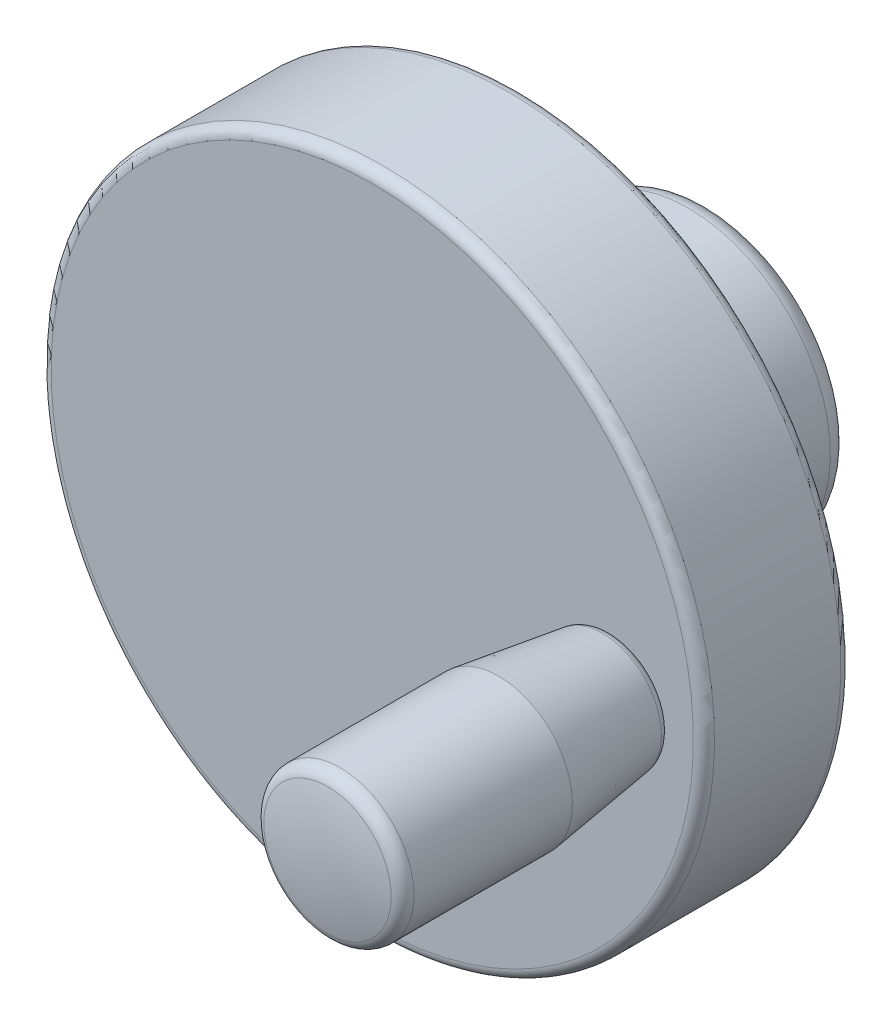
ISO-10303-21;
HEADER;
FILE_DESCRIPTION(('STEP AP214'),'2;1');
FILE_NAME('part.step','',(''),(''),'','','');
FILE_SCHEMA(('AUTOMOTIVE_DESIGN { 1 0 10303 214 1 1 1 1 }'));
ENDSEC;
DATA;
#1=APPLICATION_CONTEXT('core data for automotive mechanical design processes');
#2=APPLICATION_PROTOCOL_DEFINITION('international standard','automotive_design',2000,#1);
#3=PRODUCT_CONTEXT('',#1,'mechanical');
#4=PRODUCT('Part','Part','',(#3));
#5=PRODUCT_RELATED_PRODUCT_CATEGORY('part','',(#4));
#6=PRODUCT_DEFINITION_FORMATION('','',#4);
#7=PRODUCT_DEFINITION_CONTEXT('part definition',#1,'design');
#8=PRODUCT_DEFINITION('design','',#6,#7);
#9=PRODUCT_DEFINITION_SHAPE('','',#8);
#10=(LENGTH_UNIT() NAMED_UNIT(*) SI_UNIT(.MILLI.,.METRE.));
#11=(NAMED_UNIT(*) PLANE_ANGLE_UNIT() SI_UNIT($,.RADIAN.));
#12=(NAMED_UNIT(*) SI_UNIT($,.STERADIAN.) SOLID_ANGLE_UNIT());
#13=UNCERTAINTY_MEASURE_WITH_UNIT(LENGTH_MEASURE(1.E-05),#10,'distance_accuracy_value','');
#14=(GEOMETRIC_REPRESENTATION_CONTEXT(3) GLOBAL_UNCERTAINTY_ASSIGNED_CONTEXT((#13)) GLOBAL_UNIT_ASSIGNED_CONTEXT((#10,
#11,#12)) REPRESENTATION_CONTEXT('',''));
#15=CARTESIAN_POINT('',(0.,0.,0.));
#16=DIRECTION('',(0.,0.,1.));
#17=DIRECTION('',(1.,0.,0.));
#18=AXIS2_PLACEMENT_3D('',#15,#16,#17);
#19=CARTESIAN_POINT('',(7.,0.,0.));
#20=DIRECTION('',(0.,0.,1.));
#21=DIRECTION('',(0.,1.,0.));
#22=AXIS2_PLACEMENT_3D('',#19,#20,#21);
#23=PLANE('',#22);
#24=CARTESIAN_POINT('',(0.,0.,0.));
#25=DIRECTION('',(0.,0.,1.));
#26=DIRECTION('',(0.,1.,0.));
#27=AXIS2_PLACEMENT_3D('',#24,#25,#26);
#28=CIRCLE('',#27,11.5);
#29=CARTESIAN_POINT('',(0.,11.5,0.));
#30=VERTEX_POINT('',#29);
#31=EDGE_CURVE('E46',#30,#30,#28,.T.);
#32=ORIENTED_EDGE('',*,*,#31,.F.);
#33=EDGE_LOOP('',(#32));
#34=FACE_BOUND('',#33,.T.);
#35=CARTESIAN_POINT('',(0.,0.,0.));
#36=DIRECTION('',(0.,0.,-1.));
#37=DIRECTION('',(0.,1.,0.));
#38=AXIS2_PLACEMENT_3D('',#35,#36,#37);
#39=CIRCLE('',#38,6.);
#40=CARTESIAN_POINT('',(0.,6.,0.));
#41=VERTEX_POINT('',#40);
#42=EDGE_CURVE('E67',#41,#41,#39,.T.);
#43=ORIENTED_EDGE('',*,*,#42,.F.);
#44=EDGE_LOOP('',(#43));
#45=FACE_BOUND('',#44,.T.);
#46=ADVANCED_FACE('F12',(#34,#45),#23,.F.);
#47=CARTESIAN_POINT('',(0.,0.,32.));
#48=DIRECTION('',(0.,0.,1.));
#49=DIRECTION('',(0.,1.,0.));
#50=AXIS2_PLACEMENT_3D('',#47,#48,#49);
#51=PLANE('',#50);
#52=CARTESIAN_POINT('',(23.,0.,32.));
#53=DIRECTION('',(0.,0.,1.));
#54=DIRECTION('',(0.,1.,0.));
#55=AXIS2_PLACEMENT_3D('',#52,#53,#54);
#56=CIRCLE('',#55,4.);
#57=CARTESIAN_POINT('',(23.,4.,32.));
#58=VERTEX_POINT('',#57);
#59=EDGE_CURVE('E8',#58,#58,#56,.T.);
#60=ORIENTED_EDGE('',*,*,#59,.F.);
#61=EDGE_LOOP('',(#60));
#62=FACE_BOUND('',#61,.T.);
#63=CARTESIAN_POINT('',(0.,0.,32.));
#64=DIRECTION('',(0.,0.,1.));
#65=DIRECTION('',(0.,1.,0.));
#66=AXIS2_PLACEMENT_3D('',#63,#64,#65);
#67=CIRCLE('',#66,30.5);
#68=CARTESIAN_POINT('',(0.,30.5,32.));
#69=VERTEX_POINT('',#68);
#70=EDGE_CURVE('E22',#69,#69,#67,.T.);
#71=ORIENTED_EDGE('',*,*,#70,.T.);
#72=EDGE_LOOP('',(#71));
#73=FACE_BOUND('',#72,.T.);
#74=ADVANCED_FACE('F74',(#62,#73),#51,.T.);
#75=CARTESIAN_POINT('',(0.,0.,31.));
#76=DIRECTION('',(0.,0.,1.));
#77=DIRECTION('',(0.,1.,0.));
#78=AXIS2_PLACEMENT_3D('',#75,#76,#77);
#79=TOROIDAL_SURFACE('',#78,30.5,1.);
#80=CARTESIAN_POINT('',(0.,0.,31.));
#81=DIRECTION('',(0.,0.,1.));
#82=DIRECTION('',(0.,1.,0.));
#83=AXIS2_PLACEMENT_3D('',#80,#81,#82);
#84=CIRCLE('',#83,31.5);
#85=CARTESIAN_POINT('',(0.,31.5,31.));
#86=VERTEX_POINT('',#85);
#87=EDGE_CURVE('E26',#86,#86,#84,.T.);
#88=ORIENTED_EDGE('',*,*,#87,.T.);
#89=EDGE_LOOP('',(#88));
#90=FACE_BOUND('',#89,.T.);
#91=ORIENTED_EDGE('',*,*,#70,.F.);
#92=EDGE_LOOP('',(#91));
#93=FACE_BOUND('',#92,.T.);
#94=ADVANCED_FACE('F80',(#90,#93),#79,.T.);
#95=CARTESIAN_POINT('',(0.,0.,37.));
#96=DIRECTION('',(0.,0.,1.));
#97=DIRECTION('',(0.,1.,0.));
#98=AXIS2_PLACEMENT_3D('',#95,#96,#97);
#99=CYLINDRICAL_SURFACE('',#98,31.5);
#100=CARTESIAN_POINT('',(0.,0.,19.));
#101=DIRECTION('',(0.,0.,1.));
#102=DIRECTION('',(0.,1.,0.));
#103=AXIS2_PLACEMENT_3D('',#100,#101,#102);
#104=CIRCLE('',#103,31.5);
#105=CARTESIAN_POINT('',(0.,31.5,19.));
#106=VERTEX_POINT('',#105);
#107=EDGE_CURVE('E31',#106,#106,#104,.T.);
#108=ORIENTED_EDGE('',*,*,#107,.T.);
#109=EDGE_LOOP('',(#108));
#110=FACE_BOUND('',#109,.T.);
#111=ORIENTED_EDGE('',*,*,#87,.F.);
#112=EDGE_LOOP('',(#111));
#113=FACE_BOUND('',#112,.T.);
#114=ADVANCED_FACE('F113',(#110,#113),#99,.T.);
#115=CARTESIAN_POINT('',(0.,0.,19.));
#116=DIRECTION('',(0.,0.,1.));
#117=DIRECTION('',(0.,1.,0.));
#118=AXIS2_PLACEMENT_3D('',#115,#116,#117);
#119=TOROIDAL_SURFACE('',#118,30.5,1.);
#120=CARTESIAN_POINT('',(0.,0.,18.));
#121=DIRECTION('',(0.,0.,1.));
#122=DIRECTION('',(0.,1.,0.));
#123=AXIS2_PLACEMENT_3D('',#120,#121,#122);
#124=CIRCLE('',#123,30.5);
#125=CARTESIAN_POINT('',(0.,30.5,18.));
#126=VERTEX_POINT('',#125);
#127=EDGE_CURVE('E34',#126,#126,#124,.T.);
#128=ORIENTED_EDGE('',*,*,#127,.T.);
#129=EDGE_LOOP('',(#128));
#130=FACE_BOUND('',#129,.T.);
#131=ORIENTED_EDGE('',*,*,#107,.F.);
#132=EDGE_LOOP('',(#131));
#133=FACE_BOUND('',#132,.T.);
#134=ADVANCED_FACE('F106',(#130,#133),#119,.T.);
#135=CARTESIAN_POINT('',(16.5,0.,18.));
#136=DIRECTION('',(0.,0.,1.));
#137=DIRECTION('',(0.,1.,0.));
#138=AXIS2_PLACEMENT_3D('',#135,#136,#137);
#139=PLANE('',#138);
#140=ORIENTED_EDGE('',*,*,#127,.F.);
#141=EDGE_LOOP('',(#140));
#142=FACE_BOUND('',#141,.T.);
#143=CARTESIAN_POINT('',(0.,0.,18.));
#144=DIRECTION('',(0.,0.,1.));
#145=DIRECTION('',(0.,1.,0.));
#146=AXIS2_PLACEMENT_3D('',#143,#144,#145);
#147=CIRCLE('',#146,16.5);
#148=CARTESIAN_POINT('',(0.,16.5,18.));
#149=VERTEX_POINT('',#148);
#150=EDGE_CURVE('E37',#149,#149,#147,.T.);
#151=ORIENTED_EDGE('',*,*,#150,.T.);
#152=EDGE_LOOP('',(#151));
#153=FACE_BOUND('',#152,.T.);
#154=ADVANCED_FACE('F100',(#142,#153),#139,.F.);
#155=CARTESIAN_POINT('',(0.,0.,15.));
#156=DIRECTION('',(0.,0.,1.));
#157=DIRECTION('',(0.,1.,0.));
#158=AXIS2_PLACEMENT_3D('',#155,#156,#157);
#159=TOROIDAL_SURFACE('',#158,16.5,3.);
#160=ORIENTED_EDGE('',*,*,#150,.F.);
#161=EDGE_LOOP('',(#160));
#162=FACE_BOUND('',#161,.T.);
#163=CARTESIAN_POINT('',(0.,0.,15.));
#164=DIRECTION('',(0.,0.,1.));
#165=DIRECTION('',(0.,1.,0.));
#166=AXIS2_PLACEMENT_3D('',#163,#164,#165);
#167=CIRCLE('',#166,13.5);
#168=CARTESIAN_POINT('',(0.,13.5,15.));
#169=VERTEX_POINT('',#168);
#170=EDGE_CURVE('E40',#169,#169,#167,.T.);
#171=ORIENTED_EDGE('',*,*,#170,.T.);
#172=EDGE_LOOP('',(#171));
#173=FACE_BOUND('',#172,.T.);
#174=ADVANCED_FACE('F95',(#162,#173),#159,.F.);
#175=CARTESIAN_POINT('',(0.,0.,37.));
#176=DIRECTION('',(0.,0.,1.));
#177=DIRECTION('',(0.,1.,0.));
#178=AXIS2_PLACEMENT_3D('',#175,#176,#177);
#179=CYLINDRICAL_SURFACE('',#178,13.5);
#180=CARTESIAN_POINT('',(0.,0.,2.));
#181=DIRECTION('',(0.,0.,1.));
#182=DIRECTION('',(0.,1.,0.));
#183=AXIS2_PLACEMENT_3D('',#180,#181,#182);
#184=CIRCLE('',#183,13.5);
#185=CARTESIAN_POINT('',(0.,13.5,2.));
#186=VERTEX_POINT('',#185);
#187=EDGE_CURVE('E43',#186,#186,#184,.T.);
#188=ORIENTED_EDGE('',*,*,#187,.T.);
#189=EDGE_LOOP('',(#188));
#190=FACE_BOUND('',#189,.T.);
#191=ORIENTED_EDGE('',*,*,#170,.F.);
#192=EDGE_LOOP('',(#191));
#193=FACE_BOUND('',#192,.T.);
#194=ADVANCED_FACE('F89',(#190,#193),#179,.T.);
#195=CARTESIAN_POINT('',(0.,0.,2.));
#196=DIRECTION('',(0.,0.,1.));
#197=DIRECTION('',(0.,1.,0.));
#198=AXIS2_PLACEMENT_3D('',#195,#196,#197);
#199=TOROIDAL_SURFACE('',#198,11.5,2.);
#200=ORIENTED_EDGE('',*,*,#31,.T.);
#201=EDGE_LOOP('',(#200));
#202=FACE_BOUND('',#201,.T.);
#203=ORIENTED_EDGE('',*,*,#187,.F.);
#204=EDGE_LOOP('',(#203));
#205=FACE_BOUND('',#204,.T.);
#206=ADVANCED_FACE('F85',(#202,#205),#199,.T.);
#207=CARTESIAN_POINT('',(23.,0.,35.));
#208=DIRECTION('',(0.,1.,0.));
#209=DIRECTION('',(0.,0.,-1.));
#210=AXIS2_PLACEMENT_3D('',#207,#208,#209);
#211=SPHERICAL_SURFACE('',#210,24.9999997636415);
#212=CARTESIAN_POINT('',(23.,0.,35.));
#213=DIRECTION('',(0.,0.,-1.));
#214=DIRECTION('',(0.,-1.,0.));
#215=AXIS2_PLACEMENT_3D('',#212,#213,#214);
#216=SPHERICAL_SURFACE('',#215,24.9999997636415);
#217=CARTESIAN_POINT('',(23.,0.,59.256249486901));
#218=DIRECTION('',(0.,0.,-1.));
#219=DIRECTION('',(0.,-1.,0.));
#220=AXIS2_PLACEMENT_3D('',#217,#218,#219);
#221=CIRCLE('',#220,6.0526315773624);
#222=CARTESIAN_POINT('',(23.,-6.0526315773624,59.256249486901));
#223=VERTEX_POINT('',#222);
#224=EDGE_CURVE('E49',#223,#223,#221,.T.);
#225=ORIENTED_EDGE('',*,*,#224,.F.);
#226=EDGE_LOOP('',(#225));
#227=FACE_BOUND('',#226,.T.);
#228=ADVANCED_FACE('F88',(#227),#216,.T.);
#229=CARTESIAN_POINT('',(23.,0.,58.043437));
#230=DIRECTION('',(0.,0.,-1.));
#231=DIRECTION('',(0.,-1.,0.));
#232=AXIS2_PLACEMENT_3D('',#229,#230,#231);
#233=TOROIDAL_SURFACE('',#232,5.75,1.25);
#234=CARTESIAN_POINT('',(23.,0.,58.043437));
#235=DIRECTION('',(0.,0.,-1.));
#236=DIRECTION('',(0.,-1.,0.));
#237=AXIS2_PLACEMENT_3D('',#234,#235,#236);
#238=CIRCLE('',#237,7.);
#239=CARTESIAN_POINT('',(23.,-7.,58.043437));
#240=VERTEX_POINT('',#239);
#241=EDGE_CURVE('E52',#240,#240,#238,.T.);
#242=ORIENTED_EDGE('',*,*,#241,.F.);
#243=EDGE_LOOP('',(#242));
#244=FACE_BOUND('',#243,.T.);
#245=ORIENTED_EDGE('',*,*,#224,.T.);
#246=EDGE_LOOP('',(#245));
#247=FACE_BOUND('',#246,.T.);
#248=ADVANCED_FACE('F172',(#244,#247),#233,.T.);
#249=CARTESIAN_POINT('',(23.,0.,13.));
#250=DIRECTION('',(0.,0.,-1.));
#251=DIRECTION('',(0.,-1.,0.));
#252=AXIS2_PLACEMENT_3D('',#249,#250,#251);
#253=CYLINDRICAL_SURFACE('',#252,7.);
#254=CARTESIAN_POINT('',(23.,0.,43.));
#255=DIRECTION('',(0.,0.,-1.));
#256=DIRECTION('',(0.,-1.,0.));
#257=AXIS2_PLACEMENT_3D('',#254,#255,#256);
#258=CIRCLE('',#257,7.);
#259=CARTESIAN_POINT('',(23.,-7.,43.));
#260=VERTEX_POINT('',#259);
#261=EDGE_CURVE('E55',#260,#260,#258,.T.);
#262=ORIENTED_EDGE('',*,*,#261,.F.);
#263=EDGE_LOOP('',(#262));
#264=FACE_BOUND('',#263,.T.);
#265=ORIENTED_EDGE('',*,*,#241,.T.);
#266=EDGE_LOOP('',(#265));
#267=FACE_BOUND('',#266,.T.);
#268=ADVANCED_FACE('F164',(#264,#267),#253,.T.);
#269=CARTESIAN_POINT('',(23.,0.,33.1611709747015));
#270=DIRECTION('',(0.,0.,1.));
#271=DIRECTION('',(0.,1.,0.));
#272=AXIS2_PLACEMENT_3D('',#269,#270,#271);
#273=CONICAL_SURFACE('',#272,5.62072518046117,0.139279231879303);
#274=ORIENTED_EDGE('',*,*,#261,.T.);
#275=EDGE_LOOP('',(#274));
#276=FACE_BOUND('',#275,.T.);
#277=CARTESIAN_POINT('',(23.,0.,33.1611709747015));
#278=DIRECTION('',(0.,0.,-1.));
#279=DIRECTION('',(0.,-1.,0.));
#280=AXIS2_PLACEMENT_3D('',#277,#278,#279);
#281=CIRCLE('',#280,5.62072518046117);
#282=CARTESIAN_POINT('',(23.,-5.62072518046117,33.1611709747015));
#283=VERTEX_POINT('',#282);
#284=EDGE_CURVE('E58',#283,#283,#281,.T.);
#285=ORIENTED_EDGE('',*,*,#284,.F.);
#286=EDGE_LOOP('',(#285));
#287=FACE_BOUND('',#286,.T.);
#288=ADVANCED_FACE('F156',(#276,#287),#273,.T.);
#289=CARTESIAN_POINT('',(23.,0.,33.3));
#290=DIRECTION('',(0.,0.,-1.));
#291=DIRECTION('',(0.,-1.,0.));
#292=AXIS2_PLACEMENT_3D('',#289,#290,#291);
#293=TOROIDAL_SURFACE('',#292,4.630409,0.999999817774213);
#294=CARTESIAN_POINT('',(23.,0.,32.3));
#295=DIRECTION('',(0.,0.,-1.));
#296=DIRECTION('',(0.,-1.,0.));
#297=AXIS2_PLACEMENT_3D('',#294,#295,#296);
#298=CIRCLE('',#297,4.630409);
#299=CARTESIAN_POINT('',(23.,-4.630409,32.3));
#300=VERTEX_POINT('',#299);
#301=EDGE_CURVE('E61',#300,#300,#298,.T.);
#302=ORIENTED_EDGE('',*,*,#301,.F.);
#303=EDGE_LOOP('',(#302));
#304=FACE_BOUND('',#303,.T.);
#305=ORIENTED_EDGE('',*,*,#284,.T.);
#306=EDGE_LOOP('',(#305));
#307=FACE_BOUND('',#306,.T.);
#308=ADVANCED_FACE('F148',(#304,#307),#293,.T.);
#309=CARTESIAN_POINT('',(27.,0.,32.3));
#310=DIRECTION('',(0.,0.,-1.));
#311=DIRECTION('',(0.,-1.,0.));
#312=AXIS2_PLACEMENT_3D('',#309,#310,#311);
#313=PLANE('',#312);
#314=ORIENTED_EDGE('',*,*,#301,.T.);
#315=EDGE_LOOP('',(#314));
#316=FACE_BOUND('',#315,.T.);
#317=CARTESIAN_POINT('',(23.,0.,32.3));
#318=DIRECTION('',(0.,0.,-1.));
#319=DIRECTION('',(0.,-1.,0.));
#320=AXIS2_PLACEMENT_3D('',#317,#318,#319);
#321=CIRCLE('',#320,4.);
#322=CARTESIAN_POINT('',(23.,-4.,32.3));
#323=VERTEX_POINT('',#322);
#324=EDGE_CURVE('E64',#323,#323,#321,.T.);
#325=ORIENTED_EDGE('',*,*,#324,.F.);
#326=EDGE_LOOP('',(#325));
#327=FACE_BOUND('',#326,.T.);
#328=ADVANCED_FACE('F140',(#316,#327),#313,.T.);
#329=CARTESIAN_POINT('',(23.,0.,13.));
#330=DIRECTION('',(0.,0.,-1.));
#331=DIRECTION('',(0.,-1.,0.));
#332=AXIS2_PLACEMENT_3D('',#329,#330,#331);
#333=CYLINDRICAL_SURFACE('',#332,4.);
#334=ORIENTED_EDGE('',*,*,#324,.T.);
#335=EDGE_LOOP('',(#334));
#336=FACE_BOUND('',#335,.T.);
#337=ORIENTED_EDGE('',*,*,#59,.T.);
#338=EDGE_LOOP('',(#337));
#339=FACE_BOUND('',#338,.T.);
#340=ADVANCED_FACE('F123',(#336,#339),#333,.T.);
#341=CARTESIAN_POINT('',(6.,0.,22.));
#342=DIRECTION('',(0.,0.,-1.));
#343=DIRECTION('',(0.,-1.,0.));
#344=AXIS2_PLACEMENT_3D('',#341,#342,#343);
#345=PLANE('',#344);
#346=CARTESIAN_POINT('',(0.,0.,22.));
#347=DIRECTION('',(0.,0.,1.));
#348=DIRECTION('',(0.,1.,0.));
#349=AXIS2_PLACEMENT_3D('',#346,#347,#348);
#350=CIRCLE('',#349,6.);
#351=CARTESIAN_POINT('',(0.,6.,22.));
#352=VERTEX_POINT('',#351);
#353=EDGE_CURVE('E18',#352,#352,#350,.T.);
#354=ORIENTED_EDGE('',*,*,#353,.F.);
#355=EDGE_LOOP('',(#354));
#356=FACE_BOUND('',#355,.T.);
#357=ADVANCED_FACE('F121',(#356),#345,.T.);
#358=CARTESIAN_POINT('',(0.,0.,37.));
#359=DIRECTION('',(0.,0.,1.));
#360=DIRECTION('',(0.,1.,0.));
#361=AXIS2_PLACEMENT_3D('',#358,#359,#360);
#362=CYLINDRICAL_SURFACE('',#361,6.);
#363=ORIENTED_EDGE('',*,*,#353,.T.);
#364=EDGE_LOOP('',(#363));
#365=FACE_BOUND('',#364,.T.);
#366=ORIENTED_EDGE('',*,*,#42,.T.);
#367=EDGE_LOOP('',(#366));
#368=FACE_BOUND('',#367,.T.);
#369=ADVANCED_FACE('F71',(#365,#368),#362,.F.);
#370=CLOSED_SHELL('',(#46,#74,#94,#114,#134,#154,#174,#194,#206,#228,#248,#268,#288,#308,#328,
#340,#357,#369));
#371=MANIFOLD_SOLID_BREP('B1',#370);
#372=ADVANCED_BREP_SHAPE_REPRESENTATION('',(#18,#371),#14);
#373=SHAPE_DEFINITION_REPRESENTATION(#9,#372);
ENDSEC;
END-ISO-10303-21;
